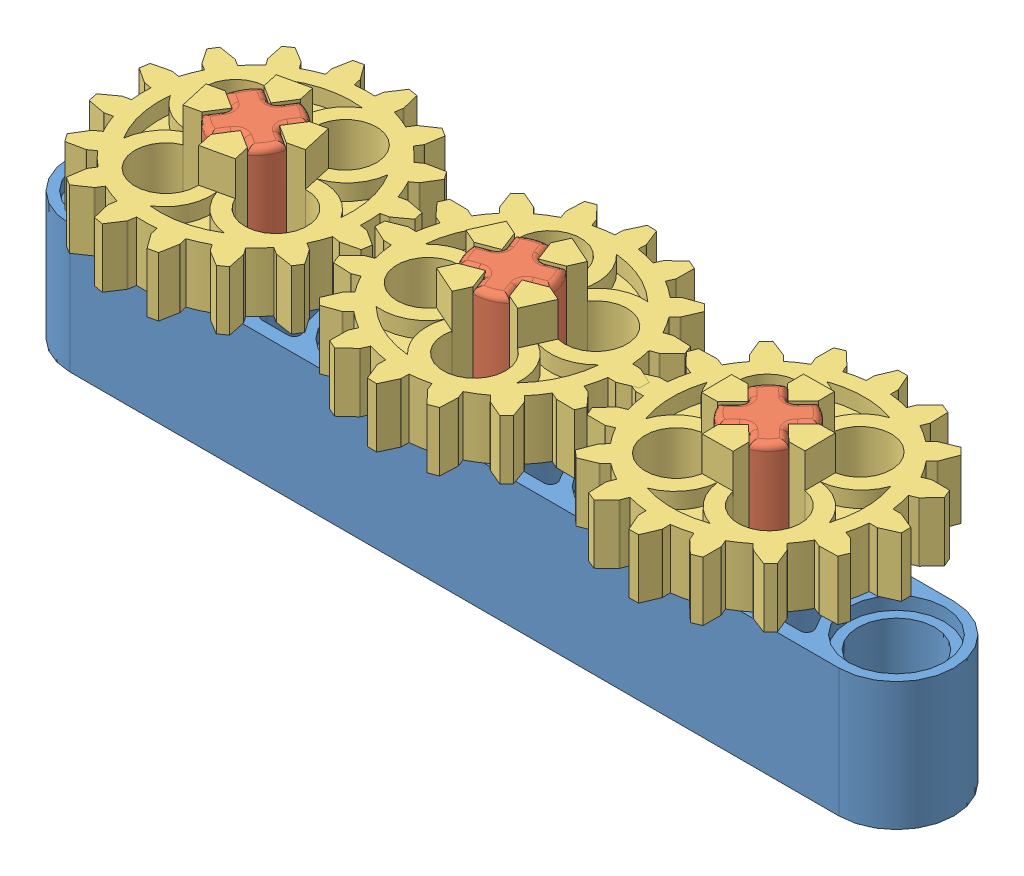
SolidWorks assembly Assem1.sldasm, configuration Default (file format 12000). Lengths in mm.
Overall size (55.75 16 24.04).
7 component instances, 3 part files, 17 mates.
Components (placement in the parent):
- 32524 Beam 7 Yellow-1: 32524 Beam 7 Yellow.SLDPRT [Default] at (-5.2119 19.5652 46.8901) size (55.2 8 7.2)
- 3749 Axle Pin without Friction Ridges Lengthwise-1: 3749 Axle Pin without Friction Ridges Lengthwise.SLDPRT [Default] at (18.7881 27.5652 46.8901) x (-0.356395 0 -0.934335) z (0.934335 0 -0.356395) size (6 16 6)
- 4019 Gear 16 Tooth-1: 4019 Gear 16 Tooth.SLDPRT [Default] at (2.7881 29.7152 46.8901) x (0.845368 0 0.534184) z (-0.534184 0 0.845368) size (17 8 17)
- 3749 Axle Pin without Friction Ridges Lengthwise-2: 3749 Axle Pin without Friction Ridges Lengthwise.SLDPRT [Default] at (34.7881 27.5652 46.8901) x (0.698781 0 -0.715336) z (0.715336 0 0.698781) size (6 16 6)
- 3749 Axle Pin without Friction Ridges Lengthwise-3: 3749 Axle Pin without Friction Ridges Lengthwise.SLDPRT [Default] at (2.7881 27.5652 46.8901) x (-0.534184 0 0.845368) z (-0.845368 0 -0.534184) size (6 16 6)
- 4019 Gear 16 Tooth-2: 4019 Gear 16 Tooth.SLDPRT [Default] at (18.7881 29.7152 46.8901) x (-0.356395 0 -0.934335) z (0.934335 0 -0.356395) size (17 8 17)
- 4019 Gear 16 Tooth-3: 4019 Gear 16 Tooth.SLDPRT [Default] at (34.7881 29.7152 46.8901) x (0.715336 0 0.698781) z (-0.698781 0 0.715336) size (17 8 17)
Mates (geometry in assembly coordinates):
- Concentric1: concentric anti-aligned: cylinder of 32524 Beam 7 Yellow-1 through (2.7881 27.5652 46.8901) axis (0 -1 0) radius 2.4; cylinder of 3749 Axle Pin without Friction Ridges Lengthwise-3 through (2.7881 19.5652 46.8901) axis (0 1 0) radius 2.4
- Concentric2: concentric anti-aligned: cylinder of 32524 Beam 7 Yellow-1 through (18.7881 27.5652 46.8901) axis (0 -1 0) radius 2.4; cylinder of 3749 Axle Pin without Friction Ridges Lengthwise-1 through (18.7881 19.5652 46.8901) axis (0 1 0) radius 2.4
- Concentric3: concentric anti-aligned: cylinder of 32524 Beam 7 Yellow-1 through (34.7881 27.5652 46.8901) axis (0 -1 0) radius 2.4; cylinder of 3749 Axle Pin without Friction Ridges Lengthwise-2 through (34.7881 19.5652 46.8901) axis (0 1 0) radius 2.4
- Coincident1: coincident anti-aligned: plane of 32524 Beam 7 Yellow-1 through (2.7881 26.7652 46.8901) normal (0 1 0); plane of 3749 Axle Pin without Friction Ridges Lengthwise-3 through (2.7881 26.7652 46.8901) normal (0 -1 0)
- Coincident2: coincident anti-aligned: plane of 32524 Beam 7 Yellow-1 through (18.7881 26.7652 46.8901) normal (0 1 0); plane of 3749 Axle Pin without Friction Ridges Lengthwise-1 through (18.7881 26.7652 46.8901) normal (0 -1 0)
- Coincident3: coincident anti-aligned: plane of 32524 Beam 7 Yellow-1 through (34.7881 26.7652 46.8901) normal (0 1 0); plane of 3749 Axle Pin without Friction Ridges Lengthwise-2 through (34.7881 26.7652 46.8901) normal (0 -1 0)
- Coincident4: coincident anti-aligned: plane of 4019 Gear 16 Tooth-1 through (5.0299 33.7152 47.7396) normal (-0.672865 0 0.739765); plane of 3749 Axle Pin without Friction Ridges Lengthwise-3 through (5.032 35.5652 47.7415) normal (0.672865 0 -0.739765)
- Coincident5: coincident anti-aligned: plane of 4019 Gear 16 Tooth-1 through (4.0312 33.7152 46.8312) normal (-0.739765 0 -0.672865); plane of 3749 Axle Pin without Friction Ridges Lengthwise-3 through (4.3003 35.5652 46.5353) normal (0.739765 0 0.672865)
- Coincident6: coincident anti-aligned: plane of 32524 Beam 7 Yellow-1 through (-5.2119 27.5652 46.8901) normal (0 1 0); plane of 4019 Gear 16 Tooth-1 through (2.7881 27.5652 46.8901) normal (0 -1 0)
- Coincident10: coincident anti-aligned: plane of 3749 Axle Pin without Friction Ridges Lengthwise-1 through (17.3234 35.5652 48.7913) normal (0.513227 0 0.858253); plane of 4019 Gear 16 Tooth-2 through (17.3258 33.7152 48.7898) normal (-0.513227 0 -0.858253)
- Coincident11: coincident: plane of 3749 Axle Pin without Friction Ridges Lengthwise-1 through (18.6897 35.5652 48.4403) normal (-0.858253 0 0.513227); line of 4019 Gear 16 Tooth-2 through (19.1773 35.5652 49.2556) axis (-0.513227 0 -0.858253)
- Coincident12: coincident anti-aligned: plane of 32524 Beam 7 Yellow-1 through (-5.2119 27.5652 46.8901) normal (0 1 0); plane of 4019 Gear 16 Tooth-2 through (18.7881 27.5652 46.8901) normal (0 -1 0)
- Coincident13: coincident anti-aligned: plane of 3749 Axle Pin without Friction Ridges Lengthwise-2 through (36.3411 35.5652 46.8586) normal (0.583126 0 0.812382); plane of 4019 Gear 16 Tooth-3 through (36.0161 33.7152 47.0918) normal (-0.583126 0 -0.812382)
- Coincident14: coincident anti-aligned: plane of 3749 Axle Pin without Friction Ridges Lengthwise-2 through (36.805 35.5652 48.1909) normal (0.812382 0 -0.583126); plane of 4019 Gear 16 Tooth-3 through (36.8033 33.7152 48.1885) normal (-0.812382 0 0.583126)
- Coincident15: coincident anti-aligned: plane of 32524 Beam 7 Yellow-1 through (-5.2119 27.5652 46.8901) normal (0 1 0); plane of 4019 Gear 16 Tooth-3 through (34.7881 27.5652 46.8901) normal (0 -1 0)
- GearMate1: gear = 14 mm: circle of 4019 Gear 16 Tooth-1; circle of 4019 Gear 16 Tooth-2
- GearMate2: gear = 14 mm: circle of 4019 Gear 16 Tooth-2; circle of 4019 Gear 16 Tooth-3
